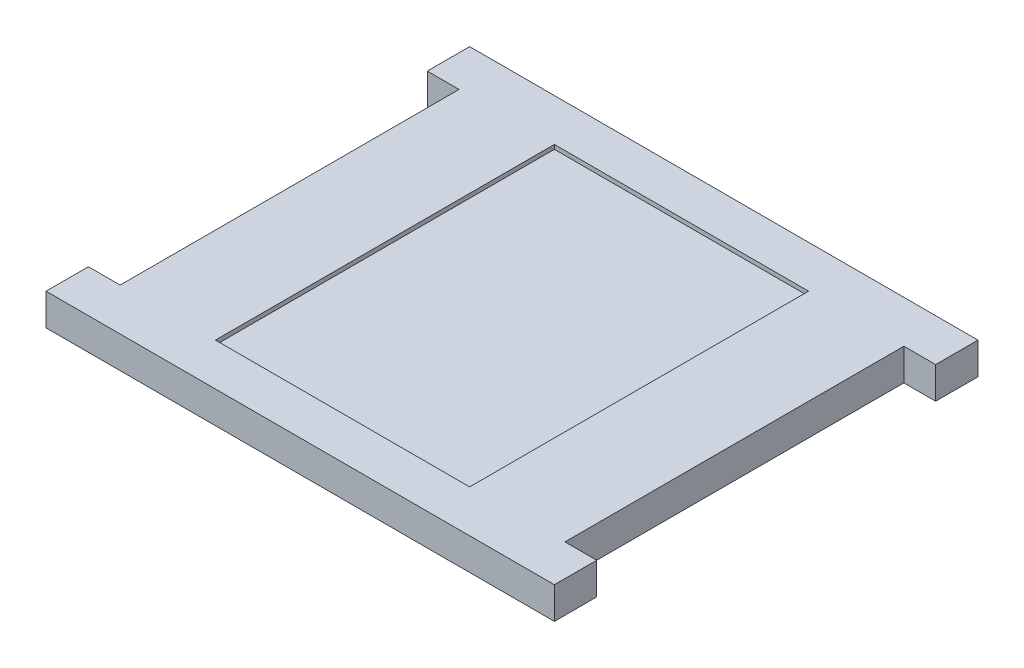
from build123d import *

# Parameters (mm, degrees)
SKETCH1_W           = 304.8
SKETCH1_H           = 254
BOSS_EXTRUDE1_DEPTH = 19.05
SKETCH2_W           = 19.05
SKETCH2_H           = 203.2
CUT_EXTRUDE1_DEPTH  = 19.05
SKETCH5_W           = 152.4
SKETCH5_H           = 203.2
CUT_EXTRUDE2_DEPTH  = 2.54


with BuildPart() as part:
    # Sketch1 → Boss-Extrude1 (new body)
    with BuildSketch(Plane(origin=(0, 0, 0), x_dir=(1, 0, 0), z_dir=(0, 1, 0))):
        with Locations((-102.481944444, -37.041666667)):
            Rectangle(SKETCH1_W, SKETCH1_H)
    extrude(amount=BOSS_EXTRUDE1_DEPTH)

    # Sketch2 → Cut-Extrude1 (cut)
    with BuildSketch(Plane(origin=(0, 19.05, 0), x_dir=(1, 0, 0), z_dir=(0, 1, 0))):
        with Locations((-245.356944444, -37.041666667)):
            Rectangle(SKETCH2_W, SKETCH2_H)
    cut_extrude1 = extrude(amount=-CUT_EXTRUDE1_DEPTH, mode=Mode.SUBTRACT)

    # Mirror1: Cut-Extrude1 across plane
    add(cut_extrude1.mirror(Plane(origin=(-102.481944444, 0, 0), x_dir=(0, 0, 1), z_dir=(1, 0, 0))), mode=Mode.SUBTRACT)

    # Sketch5 → Cut-Extrude2 (cut)
    with BuildSketch(Plane(origin=(0, 19.05, 0), x_dir=(1, 0, 0), z_dir=(0, 1, 0))):
        with Locations((-102.481944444, -37.041666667)):
            Rectangle(SKETCH5_W, SKETCH5_H)
    extrude(amount=-CUT_EXTRUDE2_DEPTH, mode=Mode.SUBTRACT)


solid = part.part
